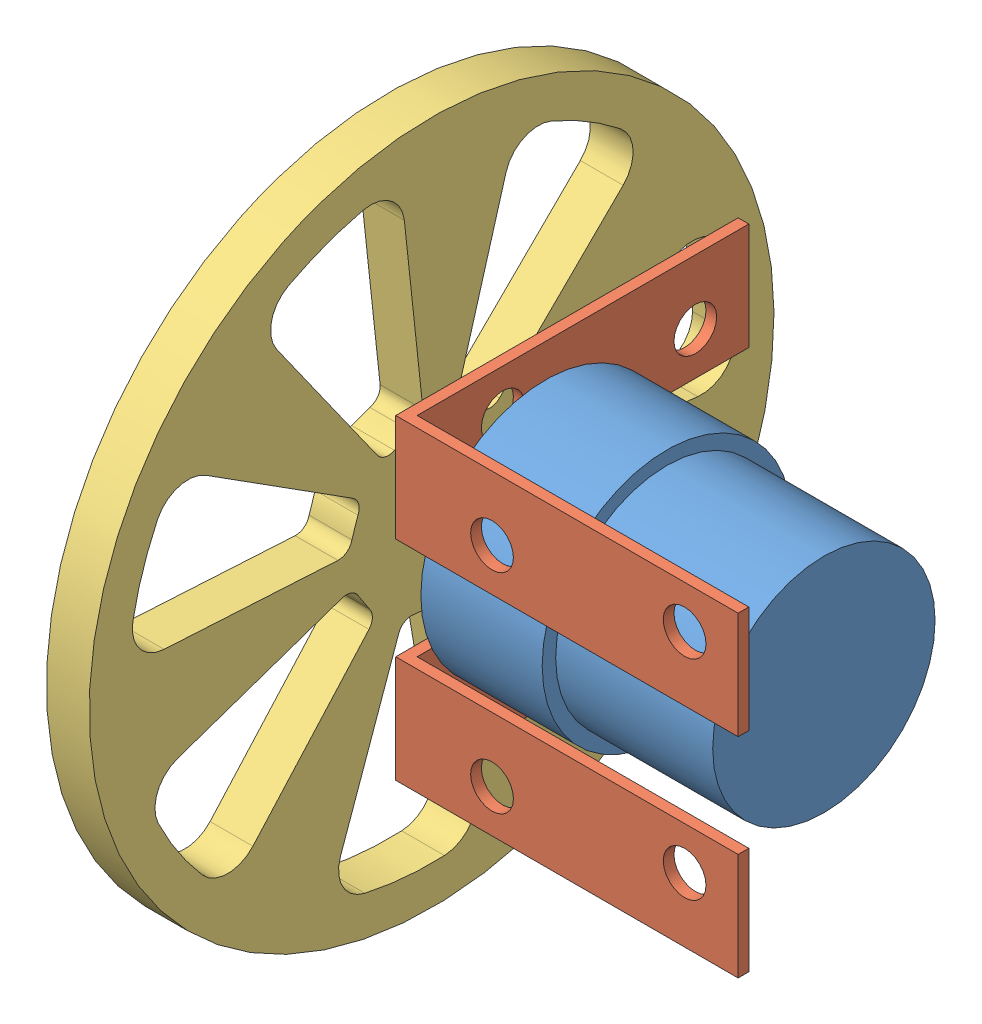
SolidWorks assembly roller wheel + hub + motor.SLDASM, configuration Default (file format 3800). Lengths in mm.
Overall size (71.81 132.7 132.7).
4 component instances, 3 part files, 8 mates.
Components (placement in the parent):
- dc motor - jameco_161382-1: dc motor - jameco_161382.SLDPRT [Default] at (-23.1125 8.981 -29.4197) x (0 0 1) z (-1 0 0) size (37 37 63.9)
- L channel _bracket style-1: L channel _bracket style.SLDPRT [Default] at (26.1 -14.4565 9.7178) size (50.8 15.88 50.8)
- L channel _bracket style-2: L channel _bracket style.SLDPRT [Default] at (26.1 16.5435 9.7178) size (50.8 15.88 50.8)
- acrylic wheel 4in diameter-1: acrylic wheel 4in diameter.SLDPRT [Default] at (-33.0125 8.981 -3.9197) x (0 0.381849 -0.924225) z (0 0.924225 0.381849) size (101.6 6.35 101.6)
Mates (geometry in assembly coordinates):
- Concentric7: concentric anti-aligned: cylinder of dc motor - jameco_161382-1; cylinder of L channel _bracket style-1
- Coincident3: coincident anti-aligned: plane of dc motor - jameco_161382-1 through (-23.1125 8.981 -10.9197) normal (-1 0 0); plane of L channel _bracket style-1 through (-23.1125 1.4185 -41.0822) normal (1 0 0)
- Concentric8: concentric anti-aligned: cylinder of dc motor - jameco_161382-1; cylinder of L channel _bracket style-2
- Coincident4: coincident anti-aligned: plane of dc motor - jameco_161382-1 through (-23.1125 8.981 -10.9197) normal (-1 0 0); plane of L channel _bracket style-2 through (-23.1125 32.4185 -41.0822) normal (1 0 0)
- Parallel1: parallel aligned: plane of L channel _bracket style-1 through (26.1 1.4185 9.7178) normal (0 0 1); plane of L channel _bracket style-2 through (26.1 32.4185 9.7178) normal (0 0 1)
- Coincident5: coincident aligned: plane of L channel _bracket style-1 through (26.1 1.4185 9.7178) normal (0 0 1); plane of L channel _bracket style-2 through (26.1 32.4185 9.7178) normal (0 0 1)
- Concentric9: concentric aligned: cylinder of dc motor - jameco_161382-1; cylinder of acrylic wheel 4in diameter-1
- Distance1: distance = 12.7 mm anti-aligned: plane of dc motor - jameco_161382-1 through (-45.7125 8.981 -3.9197) normal (-1 0 0); plane of acrylic wheel 4in diameter-1 through (-33.0125 8.981 -3.9197) normal (1 0 0)
